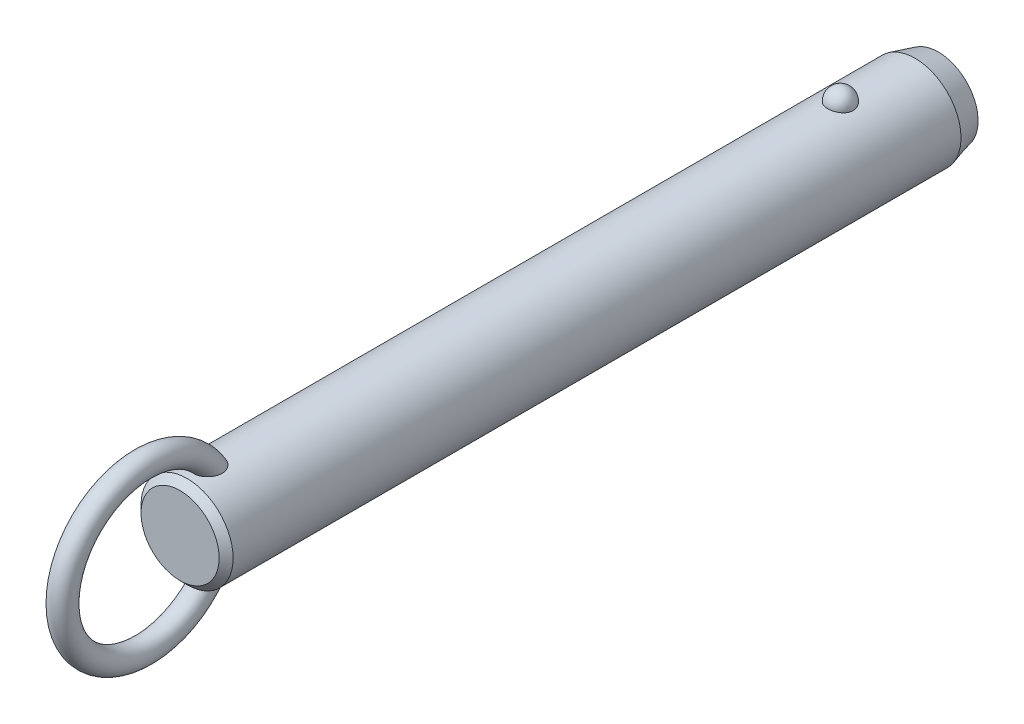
ISO-10303-21;
HEADER;
FILE_DESCRIPTION(('STEP AP214'),'2;1');
FILE_NAME('part.step','',(''),(''),'','','');
FILE_SCHEMA(('AUTOMOTIVE_DESIGN { 1 0 10303 214 1 1 1 1 }'));
ENDSEC;
DATA;
#1=APPLICATION_CONTEXT('core data for automotive mechanical design processes');
#2=APPLICATION_PROTOCOL_DEFINITION('international standard','automotive_design',2000,#1);
#3=PRODUCT_CONTEXT('',#1,'mechanical');
#4=PRODUCT('Part','Part','',(#3));
#5=PRODUCT_RELATED_PRODUCT_CATEGORY('part','',(#4));
#6=PRODUCT_DEFINITION_FORMATION('','',#4);
#7=PRODUCT_DEFINITION_CONTEXT('part definition',#1,'design');
#8=PRODUCT_DEFINITION('design','',#6,#7);
#9=PRODUCT_DEFINITION_SHAPE('','',#8);
#10=(LENGTH_UNIT() NAMED_UNIT(*) SI_UNIT(.MILLI.,.METRE.));
#11=(NAMED_UNIT(*) PLANE_ANGLE_UNIT() SI_UNIT($,.RADIAN.));
#12=(NAMED_UNIT(*) SI_UNIT($,.STERADIAN.) SOLID_ANGLE_UNIT());
#13=UNCERTAINTY_MEASURE_WITH_UNIT(LENGTH_MEASURE(1.E-05),#10,'distance_accuracy_value','');
#14=(GEOMETRIC_REPRESENTATION_CONTEXT(3) GLOBAL_UNCERTAINTY_ASSIGNED_CONTEXT((#13)) GLOBAL_UNIT_ASSIGNED_CONTEXT((#10,
#11,#12)) REPRESENTATION_CONTEXT('',''));
#15=CARTESIAN_POINT('',(0.,0.,0.));
#16=DIRECTION('',(0.,0.,1.));
#17=DIRECTION('',(1.,0.,0.));
#18=AXIS2_PLACEMENT_3D('',#15,#16,#17);
#19=CARTESIAN_POINT('',(0.,0.,101.6));
#20=DIRECTION('',(0.,0.,-1.));
#21=DIRECTION('',(-1.,0.,0.));
#22=AXIS2_PLACEMENT_3D('',#19,#20,#21);
#23=CYLINDRICAL_SURFACE('',#22,7.9);
#24=CARTESIAN_POINT('',(2.1785689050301,7.59367088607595,-2.19999999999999));
#25=CARTESIAN_POINT('',(2.17856679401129,7.59367269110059,-2.07701843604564));
#26=CARTESIAN_POINT('',(2.16853481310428,7.59657145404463,-1.95401006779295));
#27=CARTESIAN_POINT('',(2.12864689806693,7.607843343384,-1.71147811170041));
#28=CARTESIAN_POINT('',(2.09878338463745,7.61621856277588,-1.59195587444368));
#29=CARTESIAN_POINT('',(2.0199931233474,7.63749180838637,-1.3598563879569));
#30=CARTESIAN_POINT('',(1.97107475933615,7.6503878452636,-1.24727610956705));
#31=CARTESIAN_POINT('',(1.85539377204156,7.67926115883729,-1.03213234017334));
#32=CARTESIAN_POINT('',(1.78863158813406,7.69523835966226,-0.929568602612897));
#33=CARTESIAN_POINT('',(1.63856494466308,7.7285848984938,-0.736786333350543));
#34=CARTESIAN_POINT('',(1.55518140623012,7.7459606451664,-0.646630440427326));
#35=CARTESIAN_POINT('',(1.37422937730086,7.78009978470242,-0.481747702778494));
#36=CARTESIAN_POINT('',(1.27666086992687,7.79686317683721,-0.407020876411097));
#37=CARTESIAN_POINT('',(1.07024728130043,7.82786153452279,-0.275278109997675));
#38=CARTESIAN_POINT('',(0.961434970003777,7.84210353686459,-0.218212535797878));
#39=CARTESIAN_POINT('',(0.735351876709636,7.86652194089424,-0.123146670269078));
#40=CARTESIAN_POINT('',(0.618082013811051,7.87669878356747,-0.085144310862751));
#41=CARTESIAN_POINT('',(0.380637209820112,7.89170521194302,-0.0298158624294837));
#42=CARTESIAN_POINT('',(0.260550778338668,7.89662650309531,-0.0121347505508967));
#43=CARTESIAN_POINT('',(0.0190117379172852,7.90090003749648,0.00324379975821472));
#44=CARTESIAN_POINT('',(-0.102440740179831,7.90025280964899,0.00094313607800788));
#45=CARTESIAN_POINT('',(-0.341452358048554,7.89351056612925,-0.0233955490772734));
#46=CARTESIAN_POINT('',(-0.459042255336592,7.88749257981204,-0.0451545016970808));
#47=CARTESIAN_POINT('',(-0.688796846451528,7.87075812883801,-0.107408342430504));
#48=CARTESIAN_POINT('',(-0.800961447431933,7.86004158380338,-0.147903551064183));
#49=CARTESIAN_POINT('',(-1.01743634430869,7.83497131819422,-0.246799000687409));
#50=CARTESIAN_POINT('',(-1.12169791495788,7.82059709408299,-0.305300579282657));
#51=CARTESIAN_POINT('',(-1.31891765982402,7.78976470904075,-0.438549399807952));
#52=CARTESIAN_POINT('',(-1.41187469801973,7.77330633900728,-0.513298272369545));
#53=CARTESIAN_POINT('',(-1.58577142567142,7.73972434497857,-0.678622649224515));
#54=CARTESIAN_POINT('',(-1.66645140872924,7.72259402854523,-0.769470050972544));
#55=CARTESIAN_POINT('',(-1.81161503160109,7.68983776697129,-0.963538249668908));
#56=CARTESIAN_POINT('',(-1.87609753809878,7.6742119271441,-1.06675991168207));
#57=CARTESIAN_POINT('',(-1.98790138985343,7.6460202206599,-1.28401170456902));
#58=CARTESIAN_POINT('',(-2.03501994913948,7.63349104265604,-1.39815107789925));
#59=CARTESIAN_POINT('',(-2.10986724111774,7.6131449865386,-1.63301784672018));
#60=CARTESIAN_POINT('',(-2.1375965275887,7.60532797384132,-1.75374505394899));
#61=CARTESIAN_POINT('',(-2.17289256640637,7.5953195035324,-1.99782562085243));
#62=CARTESIAN_POINT('',(-2.18054294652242,7.59310471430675,-2.12116592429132));
#63=CARTESIAN_POINT('',(-2.17572919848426,7.59448538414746,-2.36741799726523));
#64=CARTESIAN_POINT('',(-2.1632656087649,7.59808068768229,-2.49032977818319));
#65=CARTESIAN_POINT('',(-2.11865035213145,7.61064035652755,-2.73161015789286));
#66=CARTESIAN_POINT('',(-2.08659579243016,7.61957823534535,-2.84999812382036));
#67=CARTESIAN_POINT('',(-2.00367799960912,7.64179982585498,-3.07955956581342));
#68=CARTESIAN_POINT('',(-1.9528140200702,7.65508371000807,-3.19073275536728));
#69=CARTESIAN_POINT('',(-1.83321113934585,7.68460381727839,-3.40337899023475));
#70=CARTESIAN_POINT('',(-1.76437735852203,7.70085556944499,-3.50479651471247));
#71=CARTESIAN_POINT('',(-1.61069526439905,7.73445734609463,-3.69446912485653));
#72=CARTESIAN_POINT('',(-1.52584634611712,7.75180741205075,-3.78272371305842));
#73=CARTESIAN_POINT('',(-1.34198059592,7.78574608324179,-3.94393987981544));
#74=CARTESIAN_POINT('',(-1.24291308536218,7.80233167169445,-4.01684434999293));
#75=CARTESIAN_POINT('',(-1.03352039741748,7.83281625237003,-4.14489386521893));
#76=CARTESIAN_POINT('',(-0.92319600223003,7.84671543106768,-4.20004014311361));
#77=CARTESIAN_POINT('',(-0.695822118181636,7.87011575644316,-4.29042017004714));
#78=CARTESIAN_POINT('',(-0.578872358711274,7.87966903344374,-4.32589112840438));
#79=CARTESIAN_POINT('',(-0.340410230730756,7.8935652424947,-4.37692226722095));
#80=CARTESIAN_POINT('',(-0.218898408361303,7.89790879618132,-4.39248482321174));
#81=CARTESIAN_POINT('',(0.0228107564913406,7.90087453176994,-4.40314405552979));
#82=CARTESIAN_POINT('',(0.142990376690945,7.89960185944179,-4.39861683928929));
#83=CARTESIAN_POINT('',(0.380829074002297,7.89171262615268,-4.37008293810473));
#84=CARTESIAN_POINT('',(0.498488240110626,7.8850962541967,-4.34607694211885));
#85=CARTESIAN_POINT('',(0.727535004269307,7.86726442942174,-4.27939317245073));
#86=CARTESIAN_POINT('',(0.838944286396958,7.85606616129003,-4.236785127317));
#87=CARTESIAN_POINT('',(1.05295421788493,7.83025654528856,-4.13408348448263));
#88=CARTESIAN_POINT('',(1.15555431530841,7.81564498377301,-4.07398879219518));
#89=CARTESIAN_POINT('',(1.35076763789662,7.7843022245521,-3.93687432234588));
#90=CARTESIAN_POINT('',(1.4432046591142,7.76754209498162,-3.85961036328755));
#91=CARTESIAN_POINT('',(1.6139111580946,7.73387857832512,-3.69076949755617));
#92=CARTESIAN_POINT('',(1.6921781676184,7.71697516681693,-3.59919010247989));
#93=CARTESIAN_POINT('',(1.83380875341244,7.6845643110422,-3.40247278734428));
#94=CARTESIAN_POINT('',(1.89689280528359,7.66908588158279,-3.29712873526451));
#95=CARTESIAN_POINT('',(2.0047823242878,7.64159441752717,-3.07707931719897));
#96=CARTESIAN_POINT('',(2.0495945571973,7.62958010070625,-2.96237743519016));
#97=CARTESIAN_POINT('',(2.11580183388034,7.61146617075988,-2.74040519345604));
#98=CARTESIAN_POINT('',(2.13929812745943,7.60484503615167,-2.63379846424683));
#99=CARTESIAN_POINT('',(2.17068242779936,7.59594664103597,-2.41813481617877));
#100=CARTESIAN_POINT('',(2.17857077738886,7.59366928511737,-2.30907795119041));
#101=CARTESIAN_POINT('',(2.1785689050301,7.59367088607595,-2.19999999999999));
#102=B_SPLINE_CURVE_WITH_KNOTS('',3,(#24,#25,#26,#27,#28,#29,#30,#31,#32,#33,#34,#35,#36,#37,
#38,#39,#40,#41,#42,#43,#44,#45,#46,#47,#48,#49,#50,#51,#52,#53,#54,#55,#56,#57,#58,#59,#60,#61,
#62,#63,#64,#65,#66,#67,#68,#69,#70,#71,#72,#73,#74,#75,#76,#77,#78,#79,#80,#81,#82,#83,#84,#85,
#86,#87,#88,#89,#90,#91,#92,#93,#94,#95,#96,#97,#98,#99,#100,#101),.UNSPECIFIED.,.T.,.F.,(4,2,2,
2,2,2,2,2,2,2,2,2,2,2,2,2,2,2,2,2,2,2,2,2,2,2,2,2,2,2,2,2,2,2,2,2,2,2,4),(0.,0.368552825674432,
0.737246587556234,1.10577831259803,1.4743009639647,1.8446206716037,2.21494081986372,
2.5842105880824,2.95344028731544,3.31611630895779,3.67875788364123,4.03628044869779,
4.39380913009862,4.75338791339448,5.11300280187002,5.47939989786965,5.8458226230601,
6.21639834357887,6.58696347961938,6.95598276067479,7.32499216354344,7.69218715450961,
8.0593967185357,8.42858578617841,8.79778880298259,9.16834203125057,9.5388695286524,
9.90482699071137,10.2707407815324,10.6298333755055,10.9889132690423,11.3466585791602,
11.7044262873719,12.0676511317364,12.4309391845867,12.8004764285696,13.1698767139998,
13.4967701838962,13.8236564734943),.UNSPECIFIED.);
#103=CARTESIAN_POINT('',(2.1785689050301,7.59367088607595,-2.19999999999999));
#104=VERTEX_POINT('',#103);
#105=EDGE_CURVE('E41',#104,#104,#102,.T.);
#106=ORIENTED_EDGE('',*,*,#105,.T.);
#107=EDGE_LOOP('',(#106));
#108=FACE_BOUND('',#107,.T.);
#109=CARTESIAN_POINT('',(0.,0.,109.92));
#110=DIRECTION('',(0.,0.,1.));
#111=DIRECTION('',(1.,0.,0.));
#112=AXIS2_PLACEMENT_3D('',#109,#110,#111);
#113=CIRCLE('',#112,7.9);
#114=CARTESIAN_POINT('',(7.9,0.,109.92));
#115=VERTEX_POINT('',#114);
#116=EDGE_CURVE('E10',#115,#115,#113,.F.);
#117=ORIENTED_EDGE('',*,*,#116,.T.);
#118=EDGE_LOOP('',(#117));
#119=FACE_BOUND('',#118,.T.);
#120=CARTESIAN_POINT('',(-0.630969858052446,-7.87476203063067,103.812432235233));
#121=CARTESIAN_POINT('',(-0.73418033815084,-7.8664899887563,103.847285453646));
#122=CARTESIAN_POINT('',(-0.834476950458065,-7.85639291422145,103.890816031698));
#123=CARTESIAN_POINT('',(-1.02620356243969,-7.83366343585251,103.994094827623));
#124=CARTESIAN_POINT('',(-1.1176141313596,-7.82102565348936,104.053877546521));
#125=CARTESIAN_POINT('',(-1.28877277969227,-7.79464922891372,104.187839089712));
#126=CARTESIAN_POINT('',(-1.36854014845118,-7.78091246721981,104.261993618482));
#127=CARTESIAN_POINT('',(-1.5146152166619,-7.75380398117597,104.422494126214));
#128=CARTESIAN_POINT('',(-1.58092966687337,-7.74043207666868,104.508833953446));
#129=CARTESIAN_POINT('',(-1.70019064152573,-7.71512522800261,104.692978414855));
#130=CARTESIAN_POINT('',(-1.75284037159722,-7.70322473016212,104.790979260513));
#131=CARTESIAN_POINT('',(-1.84263464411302,-7.68224112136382,104.994102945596));
#132=CARTESIAN_POINT('',(-1.87977299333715,-7.6731591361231,105.099228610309));
#133=CARTESIAN_POINT('',(-1.94152728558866,-7.65777930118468,105.323284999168));
#134=CARTESIAN_POINT('',(-1.96475471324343,-7.65179654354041,105.442616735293));
#135=CARTESIAN_POINT('',(-1.99449499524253,-7.64409642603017,105.68342986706));
#136=CARTESIAN_POINT('',(-2.0010005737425,-7.64238092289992,105.804912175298));
#137=CARTESIAN_POINT('',(-1.99856014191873,-7.64302120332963,106.068340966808));
#138=CARTESIAN_POINT('',(-1.98680021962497,-7.64611845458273,106.21025654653));
#139=CARTESIAN_POINT('',(-1.94457772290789,-7.65696186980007,106.491118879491));
#140=CARTESIAN_POINT('',(-1.91409393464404,-7.66471330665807,106.630062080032));
#141=CARTESIAN_POINT('',(-1.82768670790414,-7.68582947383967,106.931939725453));
#142=CARTESIAN_POINT('',(-1.76772963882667,-7.70003779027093,107.093686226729));
#143=CARTESIAN_POINT('',(-1.65998501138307,-7.72371550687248,107.327695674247));
#144=CARTESIAN_POINT('',(-1.621079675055,-7.73200670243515,107.404297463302));
#145=CARTESIAN_POINT('',(-1.53727726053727,-7.74910377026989,107.554079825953));
#146=CARTESIAN_POINT('',(-1.49238215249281,-7.75790947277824,107.627261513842));
#147=CARTESIAN_POINT('',(-1.3739705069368,-7.77993338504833,107.80288382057));
#148=CARTESIAN_POINT('',(-1.29690364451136,-7.79328473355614,107.902955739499));
#149=CARTESIAN_POINT('',(-1.1288548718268,-7.81939266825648,108.090714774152));
#150=CARTESIAN_POINT('',(-1.03789926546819,-7.83215032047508,108.178424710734));
#151=CARTESIAN_POINT('',(-0.869532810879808,-7.85231710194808,108.313414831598));
#152=CARTESIAN_POINT('',(-0.795716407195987,-7.86021093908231,108.365076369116));
#153=CARTESIAN_POINT('',(-0.640813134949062,-7.87434920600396,108.456381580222));
#154=CARTESIAN_POINT('',(-0.559737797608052,-7.88059619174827,108.49604389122));
#155=CARTESIAN_POINT('',(-0.406456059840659,-7.88984116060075,108.554300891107));
#156=CARTESIAN_POINT('',(-0.335227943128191,-7.89321892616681,108.575384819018));
#157=CARTESIAN_POINT('',(-0.19019307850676,-7.89804235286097,108.60541418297));
#158=CARTESIAN_POINT('',(-0.11638863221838,-7.89948969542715,108.614370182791));
#159=CARTESIAN_POINT('',(0.0318414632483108,-7.90028409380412,108.619291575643));
#160=CARTESIAN_POINT('',(0.106268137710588,-7.89962640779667,108.615227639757));
#161=CARTESIAN_POINT('',(0.253290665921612,-7.8962818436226,108.594461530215));
#162=CARTESIAN_POINT('',(0.32588518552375,-7.8935935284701,108.577750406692));
#163=CARTESIAN_POINT('',(0.481441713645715,-7.88577340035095,108.528738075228));
#164=CARTESIAN_POINT('',(0.563611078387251,-7.88026321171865,108.494005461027));
#165=CARTESIAN_POINT('',(0.721129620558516,-7.86741729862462,108.411796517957));
#166=CARTESIAN_POINT('',(0.796466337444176,-7.86007832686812,108.364297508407));
#167=CARTESIAN_POINT('',(0.971456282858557,-7.84073285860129,108.236513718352));
#168=CARTESIAN_POINT('',(1.0671968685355,-7.82809461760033,108.151004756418));
#169=CARTESIAN_POINT('',(1.24418921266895,-7.80192439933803,107.966232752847));
#170=CARTESIAN_POINT('',(1.32540832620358,-7.78839049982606,107.866939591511));
#171=CARTESIAN_POINT('',(1.45199971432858,-7.76559693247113,107.689576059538));
#172=CARTESIAN_POINT('',(1.50085649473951,-7.75626094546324,107.613954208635));
#173=CARTESIAN_POINT('',(1.59197749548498,-7.7380727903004,107.458742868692));
#174=CARTESIAN_POINT('',(1.63423919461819,-7.72922080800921,107.379151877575));
#175=CARTESIAN_POINT('',(1.71222612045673,-7.71231959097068,107.216664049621));
#176=CARTESIAN_POINT('',(1.74794516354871,-7.70427111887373,107.133764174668));
#177=CARTESIAN_POINT('',(1.81270113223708,-7.68929240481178,106.965296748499));
#178=CARTESIAN_POINT('',(1.84173789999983,-7.68236218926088,106.879729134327));
#179=CARTESIAN_POINT('',(1.89322698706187,-7.66983757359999,106.70528702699));
#180=CARTESIAN_POINT('',(1.91558744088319,-7.66426199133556,106.616383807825));
#181=CARTESIAN_POINT('',(1.95281367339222,-7.65485915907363,106.436969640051));
#182=CARTESIAN_POINT('',(1.96767946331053,-7.65103190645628,106.346458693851));
#183=CARTESIAN_POINT('',(2.00021456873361,-7.64262981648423,106.073732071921));
#184=CARTESIAN_POINT('',(2.00600691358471,-7.6410871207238,105.889709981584));
#185=CARTESIAN_POINT('',(1.98445334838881,-7.64669564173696,105.576501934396));
#186=CARTESIAN_POINT('',(1.96607186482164,-7.65149688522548,105.446618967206));
#187=CARTESIAN_POINT('',(1.90884967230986,-7.6659762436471,105.191632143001));
#188=CARTESIAN_POINT('',(1.8700210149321,-7.67565148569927,105.066525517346));
#189=CARTESIAN_POINT('',(1.77063986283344,-7.69918471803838,104.82454013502));
#190=CARTESIAN_POINT('',(1.70993724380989,-7.71307150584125,104.707725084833));
#191=CARTESIAN_POINT('',(1.5673307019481,-7.74330306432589,104.488144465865));
#192=CARTESIAN_POINT('',(1.48543692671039,-7.75964665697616,104.385372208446));
#193=CARTESIAN_POINT('',(1.31346177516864,-7.79047523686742,104.209380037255));
#194=CARTESIAN_POINT('',(1.22547278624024,-7.80495298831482,104.134106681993));
#195=CARTESIAN_POINT('',(1.03724352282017,-7.83218597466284,104.000486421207));
#196=CARTESIAN_POINT('',(0.937008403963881,-7.84494192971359,103.942132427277));
#197=CARTESIAN_POINT('',(0.733599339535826,-7.86649045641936,103.847027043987));
#198=CARTESIAN_POINT('',(0.630941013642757,-7.87547134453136,103.809210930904));
#199=CARTESIAN_POINT('',(0.420465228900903,-7.88950708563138,103.751116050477));
#200=CARTESIAN_POINT('',(0.312645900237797,-7.89456050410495,103.73084369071));
#201=CARTESIAN_POINT('',(0.0960869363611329,-7.9001518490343,103.708455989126));
#202=CARTESIAN_POINT('',(-0.0126341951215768,-7.90073226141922,103.706169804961));
#203=CARTESIAN_POINT('',(-0.228766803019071,-7.89742350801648,103.719367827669));
#204=CARTESIAN_POINT('',(-0.336180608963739,-7.89354403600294,103.734813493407));
#205=CARTESIAN_POINT('',(-0.473410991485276,-7.88586871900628,103.766217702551));
#206=CARTESIAN_POINT('',(-0.50525779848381,-7.88388984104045,103.774354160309));
#207=CARTESIAN_POINT('',(-0.5684812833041,-7.87958326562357,103.792208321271));
#208=CARTESIAN_POINT('',(-0.599857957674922,-7.87725556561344,103.801926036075));
#209=CARTESIAN_POINT('',(-0.630969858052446,-7.87476203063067,103.812432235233));
#210=B_SPLINE_CURVE_WITH_KNOTS('',3,(#120,#121,#122,#123,#124,#125,#126,#127,#128,#129,#130,
#131,#132,#133,#134,#135,#136,#137,#138,#139,#140,#141,#142,#143,#144,#145,#146,#147,#148,#149,
#150,#151,#152,#153,#154,#155,#156,#157,#158,#159,#160,#161,#162,#163,#164,#165,#166,#167,#168,
#169,#170,#171,#172,#173,#174,#175,#176,#177,#178,#179,#180,#181,#182,#183,#184,#185,#186,#187,
#188,#189,#190,#191,#192,#193,#194,#195,#196,#197,#198,#199,#200,#201,#202,#203,#204,#205,#206,
#207,#208,#209),.UNSPECIFIED.,.T.,.F.,(4,2,2,2,2,2,2,2,2,2,2,2,2,2,2,2,2,2,2,2,2,2,2,2,2,2,2,2,
2,2,2,2,2,2,2,2,2,2,2,2,2,2,2,2,4),(0.,0.327622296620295,0.655945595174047,0.983718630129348,
1.3113267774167,1.64554655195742,1.9798996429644,2.3436572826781,2.70757317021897,
3.13333684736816,3.55958380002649,4.07655306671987,4.3352789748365,4.59391999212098,
4.97382437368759,5.35301797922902,5.62348245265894,5.89352465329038,6.11565959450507,
6.3376009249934,6.56004255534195,6.78264174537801,7.04930844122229,7.31645206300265,
7.70130871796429,8.08701995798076,8.3582450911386,8.62957365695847,8.90115735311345,
9.17274746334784,9.44791855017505,9.72308922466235,10.2715298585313,10.6638393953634,
11.0559179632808,11.4507403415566,11.845374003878,12.1936425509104,12.5417649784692,
12.8695063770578,13.1973674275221,13.5221104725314,13.8461490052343,13.9449071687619,
14.0436660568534),.UNSPECIFIED.);
#211=CARTESIAN_POINT('',(-0.630969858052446,-7.87476203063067,103.812432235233));
#212=VERTEX_POINT('',#211);
#213=EDGE_CURVE('E60',#212,#212,#210,.T.);
#214=ORIENTED_EDGE('',*,*,#213,.T.);
#215=EDGE_LOOP('',(#214));
#216=FACE_BOUND('',#215,.T.);
#217=CARTESIAN_POINT('',(-0.630969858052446,7.87476203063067,103.812432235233));
#218=CARTESIAN_POINT('',(-0.528918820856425,7.88293636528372,103.777979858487));
#219=CARTESIAN_POINT('',(-0.423745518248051,7.8893481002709,103.751915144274));
#220=CARTESIAN_POINT('',(-0.210236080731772,7.8979273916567,103.717282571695));
#221=CARTESIAN_POINT('',(-0.10189380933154,7.90008607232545,103.708751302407));
#222=CARTESIAN_POINT('',(0.114660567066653,7.89990877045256,103.709457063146));
#223=CARTESIAN_POINT('',(0.222872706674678,7.89757640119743,103.71867980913));
#224=CARTESIAN_POINT('',(0.436107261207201,7.88867538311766,103.754652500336));
#225=CARTESIAN_POINT('',(0.541131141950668,7.8821087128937,103.78139425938));
#226=CARTESIAN_POINT('',(0.745085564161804,7.86545130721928,103.851756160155));
#227=CARTESIAN_POINT('',(0.844015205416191,7.85536005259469,103.895378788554));
#228=CARTESIAN_POINT('',(1.03299167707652,7.83275153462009,103.998379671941));
#229=CARTESIAN_POINT('',(1.12303841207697,7.8202342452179,104.057758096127));
#230=CARTESIAN_POINT('',(1.29214734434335,7.79408219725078,104.190864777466));
#231=CARTESIAN_POINT('',(1.37116907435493,7.78044359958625,104.264643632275));
#232=CARTESIAN_POINT('',(1.51597677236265,7.75353170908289,104.424235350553));
#233=CARTESIAN_POINT('',(1.58176261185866,7.74025841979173,104.510048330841));
#234=CARTESIAN_POINT('',(1.70057386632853,7.71504069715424,104.693644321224));
#235=CARTESIAN_POINT('',(1.75320073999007,7.70314257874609,104.791690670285));
#236=CARTESIAN_POINT('',(1.84293767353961,7.68216822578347,104.994893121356));
#237=CARTESIAN_POINT('',(1.88004278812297,7.67309289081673,105.100051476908));
#238=CARTESIAN_POINT('',(1.9417232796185,7.6577294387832,105.324167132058));
#239=CARTESIAN_POINT('',(1.96491037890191,7.65175648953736,105.443524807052));
#240=CARTESIAN_POINT('',(1.9945689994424,7.64407702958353,105.684384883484));
#241=CARTESIAN_POINT('',(2.00103304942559,7.64237242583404,105.80588821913));
#242=CARTESIAN_POINT('',(1.9985016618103,7.64303650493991,106.069368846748));
#243=CARTESIAN_POINT('',(1.98669038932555,7.64614714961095,106.211314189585));
#244=CARTESIAN_POINT('',(1.94436120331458,7.6570170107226,106.492228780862));
#245=CARTESIAN_POINT('',(1.91382203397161,7.66478150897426,106.631194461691));
#246=CARTESIAN_POINT('',(1.82728754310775,7.68592483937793,106.933111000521));
#247=CARTESIAN_POINT('',(1.76725778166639,7.7001468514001,107.094872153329));
#248=CARTESIAN_POINT('',(1.65939700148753,7.72384204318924,107.328891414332));
#249=CARTESIAN_POINT('',(1.62045187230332,7.73213852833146,107.405494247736));
#250=CARTESIAN_POINT('',(1.53656684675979,7.74924489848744,107.555273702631));
#251=CARTESIAN_POINT('',(1.49162892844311,7.75805461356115,107.628451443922));
#252=CARTESIAN_POINT('',(1.37317698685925,7.78007342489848,107.803952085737));
#253=CARTESIAN_POINT('',(1.29612360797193,7.79341423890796,107.903911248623));
#254=CARTESIAN_POINT('',(1.12812043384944,7.81949839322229,108.09145083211));
#255=CARTESIAN_POINT('',(1.03719688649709,7.83224280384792,108.179054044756));
#256=CARTESIAN_POINT('',(0.868871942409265,7.85239026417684,108.31389715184));
#257=CARTESIAN_POINT('',(0.795056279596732,7.86027769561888,108.365511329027));
#258=CARTESIAN_POINT('',(0.640160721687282,7.87440222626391,108.456720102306));
#259=CARTESIAN_POINT('',(0.559092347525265,7.88064188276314,108.496333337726));
#260=CARTESIAN_POINT('',(0.405820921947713,7.8898738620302,108.554505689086));
#261=CARTESIAN_POINT('',(0.334594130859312,7.89324577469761,108.575552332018));
#262=CARTESIAN_POINT('',(0.189568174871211,7.89805733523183,108.605507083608));
#263=CARTESIAN_POINT('',(0.115771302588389,7.89949866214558,108.614425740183));
#264=CARTESIAN_POINT('',(-0.0324359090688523,7.90028156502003,108.61927589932));
#265=CARTESIAN_POINT('',(-0.106847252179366,7.89961843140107,108.615178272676));
#266=CARTESIAN_POINT('',(-0.253834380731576,7.8962642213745,108.594351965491));
#267=CARTESIAN_POINT('',(-0.326408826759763,7.89357170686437,108.577614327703));
#268=CARTESIAN_POINT('',(-0.481962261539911,7.88574179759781,108.528539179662));
#269=CARTESIAN_POINT('',(-0.564145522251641,7.88022507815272,108.493763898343));
#270=CARTESIAN_POINT('',(-0.721685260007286,7.86736646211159,108.411468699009));
#271=CARTESIAN_POINT('',(-0.797029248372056,7.8600213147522,108.363926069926));
#272=CARTESIAN_POINT('',(-0.972044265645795,7.84066026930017,108.236026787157));
#273=CARTESIAN_POINT('',(-1.06779803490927,7.82801274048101,108.150443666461));
#274=CARTESIAN_POINT('',(-1.24480531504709,7.80182621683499,107.965522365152));
#275=CARTESIAN_POINT('',(-1.32602618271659,7.78828530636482,107.866154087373));
#276=CARTESIAN_POINT('',(-1.45259834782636,7.76548487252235,107.688680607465));
#277=CARTESIAN_POINT('',(-1.50143856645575,7.75614818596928,107.613025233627));
#278=CARTESIAN_POINT('',(-1.59252410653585,7.73796020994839,107.457748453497));
#279=CARTESIAN_POINT('',(-1.63476690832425,7.72910910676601,107.378125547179));
#280=CARTESIAN_POINT('',(-1.71271318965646,7.71221133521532,107.215575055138));
#281=CARTESIAN_POINT('',(-1.74841047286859,7.70416543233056,107.132644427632));
#282=CARTESIAN_POINT('',(-1.81311929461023,7.6891937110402,106.964116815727));
#283=CARTESIAN_POINT('',(-1.84213067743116,7.6822679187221,106.878519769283));
#284=CARTESIAN_POINT('',(-1.89356259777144,7.66975461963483,106.704025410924));
#285=CARTESIAN_POINT('',(-1.91589165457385,7.66418586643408,106.615099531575));
#286=CARTESIAN_POINT('',(-1.95305070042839,7.65479859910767,106.435642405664));
#287=CARTESIAN_POINT('',(-1.96788069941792,7.65098008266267,106.345111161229));
#288=CARTESIAN_POINT('',(-2.00030078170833,7.64260704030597,106.072327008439));
#289=CARTESIAN_POINT('',(-2.00600576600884,7.64108760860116,105.888271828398));
#290=CARTESIAN_POINT('',(-1.98428483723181,7.64673945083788,105.575080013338));
#291=CARTESIAN_POINT('',(-1.96583698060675,7.6515575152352,105.445240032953));
#292=CARTESIAN_POINT('',(-1.90848948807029,7.66606613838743,105.190361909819));
#293=CARTESIAN_POINT('',(-1.86960376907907,7.67575338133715,105.065320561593));
#294=CARTESIAN_POINT('',(-1.7701342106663,7.69930132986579,104.823500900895));
#295=CARTESIAN_POINT('',(-1.70940488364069,7.71318991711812,104.706784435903));
#296=CARTESIAN_POINT('',(-1.56672953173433,7.74342495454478,104.487340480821));
#297=CARTESIAN_POINT('',(-1.48478316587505,7.75977144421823,104.38461321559));
#298=CARTESIAN_POINT('',(-1.31266325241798,7.79061163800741,104.208643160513));
#299=CARTESIAN_POINT('',(-1.22456383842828,7.80509908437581,104.133358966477));
#300=CARTESIAN_POINT('',(-1.03622400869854,7.83231881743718,103.999865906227));
#301=CARTESIAN_POINT('',(-0.936015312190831,7.84505551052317,103.941613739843));
#302=CARTESIAN_POINT('',(-0.798824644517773,7.85957802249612,103.877540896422));
#303=CARTESIAN_POINT('',(-0.765787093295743,7.86286821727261,103.863224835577));
#304=CARTESIAN_POINT('',(-0.698939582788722,7.86909211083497,103.836436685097));
#305=CARTESIAN_POINT('',(-0.66512963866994,7.8720258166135,103.823964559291));
#306=CARTESIAN_POINT('',(-0.630969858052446,7.87476203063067,103.812432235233));
#307=B_SPLINE_CURVE_WITH_KNOTS('',3,(#217,#218,#219,#220,#221,#222,#223,#224,#225,#226,#227,
#228,#229,#230,#231,#232,#233,#234,#235,#236,#237,#238,#239,#240,#241,#242,#243,#244,#245,#246,
#247,#248,#249,#250,#251,#252,#253,#254,#255,#256,#257,#258,#259,#260,#261,#262,#263,#264,#265,
#266,#267,#268,#269,#270,#271,#272,#273,#274,#275,#276,#277,#278,#279,#280,#281,#282,#283,#284,
#285,#286,#287,#288,#289,#290,#291,#292,#293,#294,#295,#296,#297,#298,#299,#300,#301,#302,#303,
#304,#305,#306),.UNSPECIFIED.,.T.,.F.,(4,2,2,2,2,2,2,2,2,2,2,2,2,2,2,2,2,2,2,2,2,2,2,2,2,2,2,2,
2,2,2,2,2,2,2,2,2,2,2,2,2,2,2,2,4),(0.,0.323920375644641,0.648516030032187,0.97285063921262,
1.29703380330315,1.62126473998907,1.94549915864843,2.27089401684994,2.5962920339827,
2.93059633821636,3.26500707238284,3.6288164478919,3.99278833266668,4.41865421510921,
4.84500434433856,5.36209210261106,5.62087589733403,5.87957448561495,6.25918598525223,
6.63808782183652,6.90846748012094,7.17842501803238,7.40052350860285,7.62242871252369,
7.84483086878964,8.06739077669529,8.33414615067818,8.60137921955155,8.98641454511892,
9.3723041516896,9.64358673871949,9.91497268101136,10.1866142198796,10.4582620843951,
10.7334745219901,11.0086865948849,11.5572126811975,11.9494246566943,12.3413699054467,
12.7359755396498,13.1305875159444,13.4791770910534,13.82687259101,13.9353013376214,
14.0437279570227),.UNSPECIFIED.);
#308=CARTESIAN_POINT('',(-0.630969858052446,7.87476203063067,103.812432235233));
#309=VERTEX_POINT('',#308);
#310=EDGE_CURVE('E67',#309,#309,#307,.T.);
#311=ORIENTED_EDGE('',*,*,#310,.T.);
#312=EDGE_LOOP('',(#311));
#313=FACE_BOUND('',#312,.T.);
#314=CARTESIAN_POINT('',(0.,0.,-14.9999999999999));
#315=DIRECTION('',(0.,0.,-1.));
#316=DIRECTION('',(-1.,0.,0.));
#317=AXIS2_PLACEMENT_3D('',#314,#315,#316);
#318=CIRCLE('',#317,7.9);
#319=CARTESIAN_POINT('',(-7.9,0.,-14.9999999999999));
#320=VERTEX_POINT('',#319);
#321=EDGE_CURVE('E57',#320,#320,#318,.F.);
#322=ORIENTED_EDGE('',*,*,#321,.T.);
#323=EDGE_LOOP('',(#322));
#324=FACE_BOUND('',#323,.T.);
#325=ADVANCED_FACE('F37',(#108,#119,#216,#313,#324),#23,.T.);
#326=CARTESIAN_POINT('',(0.,0.,-19.));
#327=DIRECTION('',(0.,0.,-1.));
#328=DIRECTION('',(-1.,0.,0.));
#329=AXIS2_PLACEMENT_3D('',#326,#327,#328);
#330=PLANE('',#329);
#331=CARTESIAN_POINT('',(0.,0.,-19.));
#332=DIRECTION('',(0.,0.,-1.));
#333=DIRECTION('',(-1.,0.,0.));
#334=AXIS2_PLACEMENT_3D('',#331,#332,#333);
#335=CIRCLE('',#334,6.82820323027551);
#336=CARTESIAN_POINT('',(-6.82820323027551,0.,-19.));
#337=VERTEX_POINT('',#336);
#338=EDGE_CURVE('E66',#337,#337,#335,.T.);
#339=ORIENTED_EDGE('',*,*,#338,.T.);
#340=EDGE_LOOP('',(#339));
#341=FACE_BOUND('',#340,.T.);
#342=ADVANCED_FACE('F85',(#341),#330,.T.);
#343=CARTESIAN_POINT('',(0.,0.,-19.));
#344=DIRECTION('',(0.,0.,1.));
#345=DIRECTION('',(1.,0.,0.));
#346=AXIS2_PLACEMENT_3D('',#343,#344,#345);
#347=CONICAL_SURFACE('',#346,6.8282032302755,0.261799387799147);
#348=ORIENTED_EDGE('',*,*,#321,.F.);
#349=EDGE_LOOP('',(#348));
#350=FACE_BOUND('',#349,.T.);
#351=ORIENTED_EDGE('',*,*,#338,.F.);
#352=EDGE_LOOP('',(#351));
#353=FACE_BOUND('',#352,.T.);
#354=ADVANCED_FACE('F83',(#350,#353),#347,.T.);
#355=CARTESIAN_POINT('',(0.,0.,111.12));
#356=DIRECTION('',(0.,0.,1.));
#357=DIRECTION('',(1.,0.,0.));
#358=AXIS2_PLACEMENT_3D('',#355,#356,#357);
#359=PLANE('',#358);
#360=CARTESIAN_POINT('',(0.,0.,111.12));
#361=DIRECTION('',(0.,0.,1.));
#362=DIRECTION('',(1.,0.,0.));
#363=AXIS2_PLACEMENT_3D('',#360,#361,#362);
#364=CIRCLE('',#363,6.70000000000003);
#365=CARTESIAN_POINT('',(6.70000000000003,0.,111.12));
#366=VERTEX_POINT('',#365);
#367=EDGE_CURVE('E50',#366,#366,#364,.T.);
#368=ORIENTED_EDGE('',*,*,#367,.T.);
#369=EDGE_LOOP('',(#368));
#370=FACE_BOUND('',#369,.T.);
#371=ADVANCED_FACE('F77',(#370),#359,.T.);
#372=CARTESIAN_POINT('',(0.,0.,117.45));
#373=DIRECTION('',(1.,0.,0.));
#374=DIRECTION('',(0.,0.,-1.));
#375=AXIS2_PLACEMENT_3D('',#372,#373,#374);
#376=TOROIDAL_SURFACE('',#375,13.85,2.);
#377=ORIENTED_EDGE('',*,*,#310,.F.);
#378=EDGE_LOOP('',(#377));
#379=FACE_BOUND('',#378,.T.);
#380=ORIENTED_EDGE('',*,*,#213,.F.);
#381=EDGE_LOOP('',(#380));
#382=FACE_BOUND('',#381,.T.);
#383=ADVANCED_FACE('F73',(#379,#382),#376,.T.);
#384=CARTESIAN_POINT('',(0.,0.,111.12));
#385=DIRECTION('',(0.,0.,-1.));
#386=DIRECTION('',(-1.,0.,0.));
#387=AXIS2_PLACEMENT_3D('',#384,#385,#386);
#388=CONICAL_SURFACE('',#387,6.70000000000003,0.785398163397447);
#389=ORIENTED_EDGE('',*,*,#116,.F.);
#390=EDGE_LOOP('',(#389));
#391=FACE_BOUND('',#390,.T.);
#392=ORIENTED_EDGE('',*,*,#367,.F.);
#393=EDGE_LOOP('',(#392));
#394=FACE_BOUND('',#393,.T.);
#395=ADVANCED_FACE('F39',(#391,#394),#388,.T.);
#396=CARTESIAN_POINT('',(0.,7.9,-2.19999999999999));
#397=DIRECTION('',(0.,1.,0.));
#398=DIRECTION('',(0.,0.,1.));
#399=AXIS2_PLACEMENT_3D('',#396,#397,#398);
#400=SPHERICAL_SURFACE('',#399,2.2);
#401=ORIENTED_EDGE('',*,*,#105,.F.);
#402=EDGE_LOOP('',(#401));
#403=FACE_BOUND('',#402,.T.);
#404=ADVANCED_FACE('F79',(#403),#400,.T.);
#405=CLOSED_SHELL('',(#325,#342,#354,#371,#383,#395,#404));
#406=MANIFOLD_SOLID_BREP('B2',#405);
#407=ADVANCED_BREP_SHAPE_REPRESENTATION('',(#18,#406),#14);
#408=SHAPE_DEFINITION_REPRESENTATION(#9,#407);
ENDSEC;
END-ISO-10303-21;
